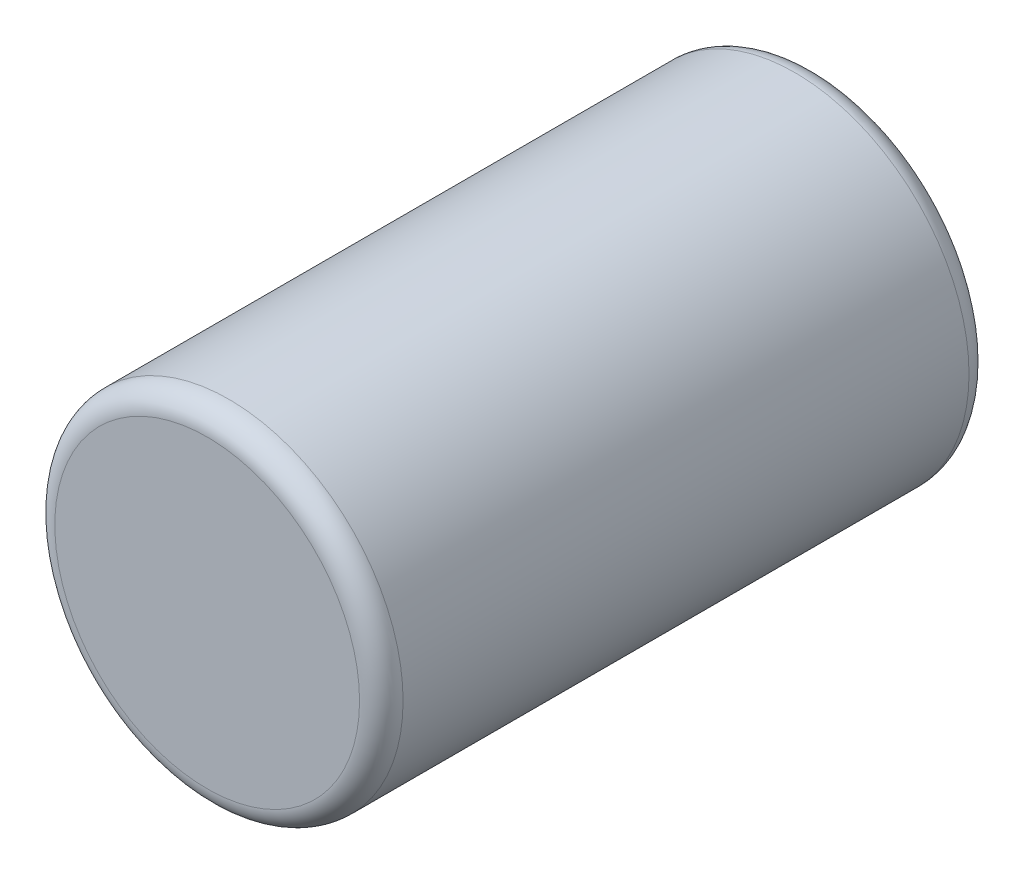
from build123d import *

# Parameters (mm, degrees)
ESQUISSE1_R          = 40
BASE_EXTRUSION_DEPTH = 140
CONG_1_R             = 5


with BuildPart() as part:
    # Esquisse1 → Base-Extrusion (new body)
    with BuildSketch(Plane.XY):
        Circle(ESQUISSE1_R)
    extrude(amount=BASE_EXTRUSION_DEPTH)

    # Cong_1
    cong_1_edges = [part.edges().sort_by_distance(p)[0] for p in [
        (-40, 0, 0),
        (-40, 0, 140),
    ]]
    fillet(cong_1_edges, radius=CONG_1_R)


solid = part.part
